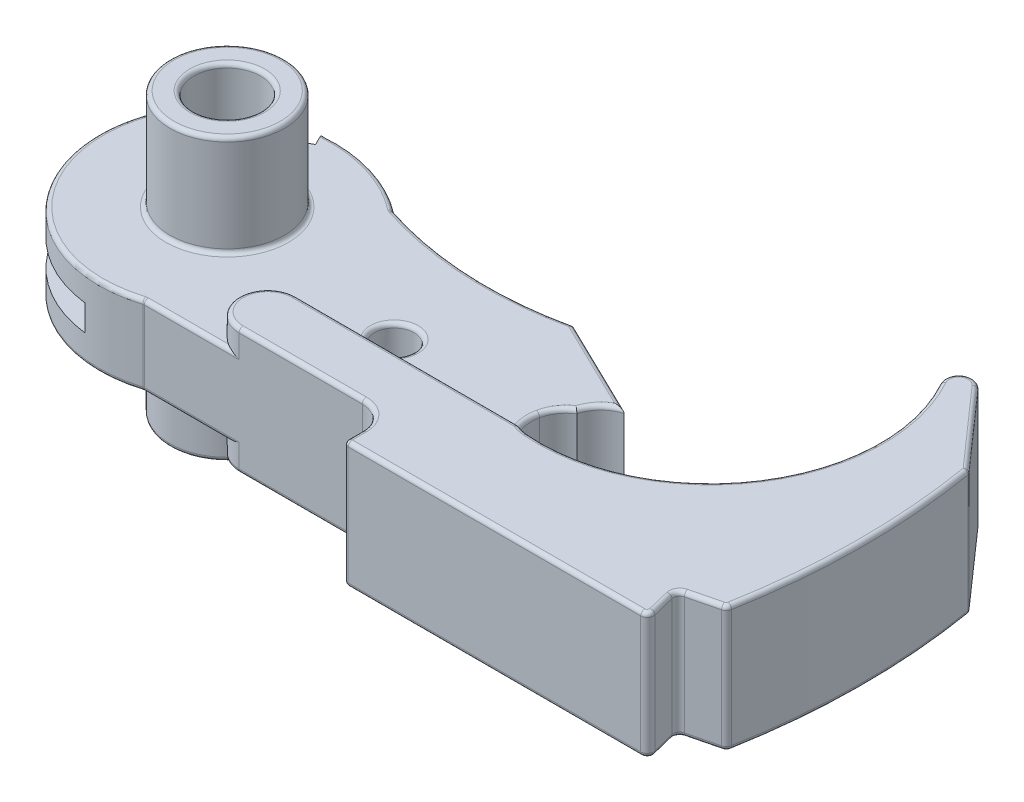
from build123d import *

# Parameters (mm, degrees)
SKETCH1_R                      = 2.055903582
SKETCH1_R_2                    = 1.2192
BOSS_EXTRUDE1_DEPTH            = 7.747
CUT_EXTRUDE1_DEPTH             = 1.4224
CUT_EXTRUDE2_START             = -1.4224
CUT_EXTRUDE2_DEPTH             = 1.4224
BOSS_EXTRUDE2_START            = 6.1976
SKETCH3_R                      = 3.52224744
SKETCH3_R_2                    = 2.055903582
BOSS_EXTRUDE2_DEPTH            = 6.1976
SKETCH5_R                      = 3.52224744
SKETCH5_R_2                    = 2.055903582
BOSS_EXTRUDE3_DEPTH            = 6.1976
SKETCH6_W                      = 9.931321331
SKETCH6_H                      = 1.6002
CUT_EXTRUDE3_DEPTH             = 14.0462
CUT_EXTRUDE4_REACH             = 44.624
CUT_EXTRUDE4_END_RADIUS        = 1.2192
SKETCH7_R                      = 0.6858
CUT_EXTRUDE4_DIRECTION_2_DEPTH = 14.0462
CUT_EXTRUDE5_DEPTH             = 5.08
CUT_EXTRUDE5_DEPTH_BACK        = 14.0462
SKETCH9_R                      = 1.5113
CUT_EXTRUDE6_DEPTH             = 5.08
FILLET1_R                      = 0.254


with BuildPart() as part:
    # Sketch1 → Boss-Extrude1 (new body)
    with BuildSketch(Plane(origin=(0, 0, 0), x_dir=(1, 0, 0), z_dir=(0, 1, 0))):
        with BuildLine():
            Line((2.378646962, -7.5184), (15.826602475, -7.5184))
            ThreePointArc((15.826602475, -7.5184), (16.958114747, -7.987087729), (17.426802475, -9.1186))
            Line((17.426802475, -9.1186), (17.426802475, -10.2362))
            Line((17.426802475, -10.2362), (35.67176, -10.2362))
            ThreePointArc((35.67176, -10.2362), (35.983910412, -10.084026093), (36.056301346, -9.744387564))
            Line((36.056301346, -9.744387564), (35.712669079, -8.361762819))
            ThreePointArc((35.712669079, -8.361762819), (35.757718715, -8.061858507), (36.00163799, -7.881649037))
            Line((36.00163799, -7.881649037), (37.833009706, -7.426486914))
            ThreePointArc((37.833009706, -7.426486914), (38.02665067, -7.312799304), (38.127412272, -7.112128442))
            ThreePointArc((38.127412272, -7.112128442), (38.796622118, 0.144373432), (38.212537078, 7.408222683))
            Line((38.212537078, 7.408222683), (34.020412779, 12.158406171))
            ThreePointArc((34.020412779, 12.158406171), (32.908966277, 12.288835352), (32.658423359, 11.198168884))
            ThreePointArc((32.658423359, 11.198168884), (32.29195261, 0.51730157), (22.704746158, -4.205060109))
            ThreePointArc((22.704746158, -4.205060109), (21.005770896, -3.265335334), (20.58481616, -1.369973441))
            ThreePointArc((20.58481616, -1.369973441), (20.91530817, -0.598324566), (21.519854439, -0.015923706))
            ThreePointArc((21.519854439, -0.015923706), (22.044520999, 0.907441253), (22.950818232, 1.461068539))
            Line((22.950818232, 1.461068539), (16.906922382, 4.395845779))
            ThreePointArc((16.906922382, 4.395845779), (11.058139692, 3.897093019), (5.284842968, 4.958251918))
            ThreePointArc((5.284842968, 4.958251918), (2.320096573, 6.483971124), (-0.997187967, 6.820369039))
            Line((-0.997187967, 6.820369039), (-0.606157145, 6.038992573))
            Line((-0.606157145, 6.038992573), (-1.946806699, 5.368079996))
            Line((-1.946806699, 5.368079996), (-2.925169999, 7.323092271))
            ThreePointArc((-2.925169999, 7.323092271), (-7.425775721, -2.653705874), (2.378646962, -7.5184))
        make_face()
        with Locations(Location((0, 0, 0), (0, 0, 270))):
            Circle(SKETCH1_R, mode=Mode.SUBTRACT)
        with Locations(Location((12.192197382, -1.920333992, 0), (0, 0, 270))):
            Circle(SKETCH1_R_2, mode=Mode.SUBTRACT)
    extrude(amount=-BOSS_EXTRUDE1_DEPTH)

    # Sketch2 → Cut-Extrude1 (cut)
    with BuildSketch(Plane(origin=(0, 0, 0), x_dir=(1, 0, 0), z_dir=(0, 1, 0))):
        with BuildLine():
            Line((21.956143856, -4.017238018), (8.250886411, -3.994576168))
            ThreePointArc((8.250886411, -3.994576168), (6.486060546, -5.755030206), (8.247973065, -7.5184))
            Line((8.247973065, -7.5184), (2.378646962, -7.5184))
            ThreePointArc((2.378646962, -7.5184), (-7.425775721, -2.653705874), (-2.925169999, 7.323092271))
            Line((-2.925169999, 7.323092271), (-1.946806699, 5.368079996))
            Line((-1.946806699, 5.368079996), (-0.606157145, 6.038992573))
            Line((-0.606157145, 6.038992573), (-0.997187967, 6.820369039))
            ThreePointArc((-0.997187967, 6.820369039), (2.320096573, 6.483971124), (5.284842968, 4.958251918))
            ThreePointArc((5.284842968, 4.958251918), (11.058139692, 3.897093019), (16.906922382, 4.395845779))
            Line((16.906922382, 4.395845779), (22.950818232, 1.461068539))
            ThreePointArc((22.950818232, 1.461068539), (22.044520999, 0.907441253), (21.519854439, -0.015923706))
            ThreePointArc((21.519854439, -0.015923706), (20.91530817, -0.598324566), (20.58481616, -1.369973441))
            ThreePointArc((20.58481616, -1.369973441), (20.800090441, -2.937275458), (21.956143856, -4.017238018))
        make_face()
    extrude(amount=-CUT_EXTRUDE1_DEPTH, mode=Mode.SUBTRACT)

    # Sketch4 → Cut-Extrude2 (cut)
    with BuildSketch(Plane.XZ.offset(7.747).offset(CUT_EXTRUDE2_START)):
        with BuildLine():
            Line((-0.606157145, -6.038992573), (-0.997187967, -6.820369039))
            ThreePointArc((-0.997187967, -6.820369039), (2.320096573, -6.483971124), (5.284842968, -4.958251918))
            ThreePointArc((5.284842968, -4.958251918), (11.058139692, -3.897093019), (16.906922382, -4.395845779))
            Line((16.906922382, -4.395845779), (22.950818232, -1.461068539))
            ThreePointArc((22.950818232, -1.461068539), (22.044520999, -0.907441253), (21.519854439, 0.015923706))
            ThreePointArc((21.519854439, 0.015923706), (20.91530817, 0.598324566), (20.58481616, 1.369973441))
            ThreePointArc((20.58481616, 1.369973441), (20.800090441, 2.937275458), (21.956143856, 4.017238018))
            Line((21.956143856, 4.017238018), (8.250886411, 3.994576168))
            ThreePointArc((8.250886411, 3.994576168), (6.486060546, 5.755030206), (8.247973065, 7.5184))
            Line((8.247973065, 7.5184), (2.378646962, 7.5184))
            ThreePointArc((2.378646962, 7.5184), (-7.425775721, 2.653705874), (-2.925169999, -7.323092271))
            Line((-2.925169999, -7.323092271), (-1.946806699, -5.368079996))
            Line((-1.946806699, -5.368079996), (-0.606157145, -6.038992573))
        make_face()
    extrude(amount=CUT_EXTRUDE2_DEPTH, mode=Mode.SUBTRACT)

    # Sketch3 → Boss-Extrude2 (add)
    with BuildSketch(Plane(origin=(0, -1.4224, 0), x_dir=(1, 0, 0), z_dir=(0, 1, 0)).offset(BOSS_EXTRUDE2_START)):
        with Locations(Location((0, 0, 0), (0, 0, 270))):
            Circle(SKETCH3_R)
        with Locations(Location((0, 0, 0), (0, 0, 270))):
            Circle(SKETCH3_R_2, mode=Mode.SUBTRACT)
    extrude(amount=-BOSS_EXTRUDE2_DEPTH)

    # Sketch5 → Boss-Extrude3 (add)
    with BuildSketch(Plane.XZ.offset(6.3246)):
        with Locations(Location((0, 0, 0), (0, 0, 90))):
            Circle(SKETCH5_R)
        with Locations(Location((0, 0, 0), (0, 0, 90))):
            Circle(SKETCH5_R_2, mode=Mode.SUBTRACT)
    extrude(amount=BOSS_EXTRUDE3_DEPTH)

    # Sketch6 → Cut-Extrude3 (cut)
    with BuildSketch(Plane(origin=(-2.53826867, 0, -5.072089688), x_dir=(-0.8942703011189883, 0, 0.4475272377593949), z_dir=(-0.4475272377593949, 0, -0.8942703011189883))):
        with Locations((9.295362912, -3.8735)):
            Rectangle(SKETCH6_W, SKETCH6_H)
    extrude(amount=-CUT_EXTRUDE3_DEPTH, mode=Mode.SUBTRACT)

    # Cut-Extrude4: up to this cylinder (the profile starts outside it)
    cut_extrude4_end = Plane(origin=(12.192197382, -3.8735, 1.920333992), z_dir=(0, 1, 0)) * Cylinder(CUT_EXTRUDE4_END_RADIUS, 92.6864, mode=Mode.PRIVATE)
    # Sketch7 → Cut-Extrude4 (cut, up to the surface)
    with BuildSketch(Plane(origin=(0, 0, 0), x_dir=(0, 0, -1), z_dir=(1, 0, 0)), mode=Mode.PRIVATE) as cut_extrude4_sk1:
        with Locations(Location((-2.055903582, -3.8735, 0), (0, 0, 180))):
            Circle(SKETCH7_R)
    cut_extrude4_tool1 = extrude(cut_extrude4_sk1.sketch, amount=CUT_EXTRUDE4_REACH, mode=Mode.PRIVATE) - cut_extrude4_end
    add(cut_extrude4_tool1.solids().sort_by_distance((0, -3.8735, 2.055904))[0], mode=Mode.SUBTRACT)

    # Sketch7 → Cut-Extrude4 direction 2 (cut)
    with BuildSketch(Plane(origin=(0, 0, 0), x_dir=(0, 0, -1), z_dir=(1, 0, 0))):
        with Locations(Location((-2.055903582, -3.8735, 0), (0, 0, 180))):
            Circle(SKETCH7_R)
    extrude(amount=-CUT_EXTRUDE4_DIRECTION_2_DEPTH, mode=Mode.SUBTRACT)

    # Sketch9 → Cut-Extrude5 (cut, two sides: drawn at the far end of the back side and taken through both)
    with BuildSketch(Plane(origin=(0, 0, 0), x_dir=(0, 0, -1), z_dir=(1, 0, 0)).offset(-CUT_EXTRUDE5_DEPTH_BACK)):
        with Locations((-2.055903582, -3.8735)):
            Circle(SKETCH9_R)
    extrude(amount=CUT_EXTRUDE5_DEPTH + CUT_EXTRUDE5_DEPTH_BACK, mode=Mode.SUBTRACT)

    # Sketch10 → Cut-Extrude6 (cut)
    with BuildSketch(Plane.XZ.offset(6.3246)):
        Polygon((-2.925169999, -7.323092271), (-10.002018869, -3.237271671), (-10.543382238, -4.099600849), (-3.276143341, -7.980340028), align=None)
    extrude(amount=-CUT_EXTRUDE6_DEPTH, mode=Mode.SUBTRACT)

    # Fillet1
    fillet1_edges = [part.edges().sort_by_distance(p)[0] for p in [
        (2.320096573, -6.3246, -6.483971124),
        (2.320096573, -1.4224, -6.483971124),
        (26.549281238, 0, 10.2362),
        (35.983910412, 0, 10.084026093),
        (35.884485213, 0, 9.053075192),
        (35.757718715, 0, 8.061858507),
        (36.917323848, 0, 7.654067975),
        (38.02665067, 0, 7.312799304),
        (26.549281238, -7.747, 10.2362),
        (35.983910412, -7.747, 10.084026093),
        (35.884485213, -7.747, 9.053075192),
        (35.757718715, -7.747, 8.061858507),
        (36.917323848, -7.747, 7.654067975),
        (38.02665067, -7.747, 7.312799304),
        (17.426802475, -7.747, 9.6774),
        (16.958114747, -7.747, 7.987087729),
        (12.03728777, -7.747, 7.5184),
        (6.486060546, -7.747, 5.755030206),
        (36.116474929, -7.747, -9.783314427),
        (32.908966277, -7.747, -12.288835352),
        (32.29195261, -7.747, -0.51730157),
        (36.116474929, 0, -9.783314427),
        (32.908966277, 0, -12.288835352),
        (32.29195261, 0, -0.51730157),
        (17.426802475, 0, 9.6774),
        (16.958114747, 0, 7.987087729),
        (12.03728777, 0, 7.5184),
        (6.486060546, 0, 5.755030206),
        (20.800090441, -1.4224, 2.937275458),
        (20.800090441, -6.3246, 2.937275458),
        (2.378646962, -3.8735, 7.5184),
        (-6.969686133, -1.4224, 3.688871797),
        (5.313310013, -1.4224, 7.5184),
        (-6.969686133, -6.3246, 3.688871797),
        (5.313310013, -6.3246, 7.5184),
        (38.796622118, 0, -0.144373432),
        (38.796622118, -7.747, -0.144373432),
        (15.103515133, -7.747, 4.005907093),
        (22.322722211, -7.747, 4.141929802),
        (22.322722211, 0, 4.141929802),
        (15.103515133, 0, 4.005907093),
        (21.956143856, -7.0358, 4.017238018),
        (21.956143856, -0.7112, 4.017238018),
        (38.212537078, -3.8735, -7.408222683),
        (17.426802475, -3.8735, 10.2362),
        (12.192197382, -1.4224, 0.701133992),
        (12.192197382, -6.3246, 0.701133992),
        (0, -12.5222, -2.055903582),
        (0, 4.7752, -2.055903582),
        (0, 4.7752, -3.52224744),
        (0, -1.4224, -3.52224744),
        (0, -6.3246, -3.52224744),
        (0, -12.5222, -3.52224744),
        (20.91530817, -1.4224, 0.598324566),
        (22.044520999, -1.4224, -0.907441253),
        (20.91530817, -6.3246, 0.598324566),
        (22.044520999, -6.3246, -0.907441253),
        (5.284842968, -3.8735, -4.958251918),
        (11.058139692, -6.3246, -3.897093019),
        (11.058139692, -1.4224, -3.897093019),
        (16.906922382, -3.8735, -4.395845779),
        (19.928870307, -1.4224, -2.928457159),
        (19.928870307, -6.3246, -2.928457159),
    ]]
    fillet(fillet1_edges, radius=FILLET1_R)


solid = part.part
